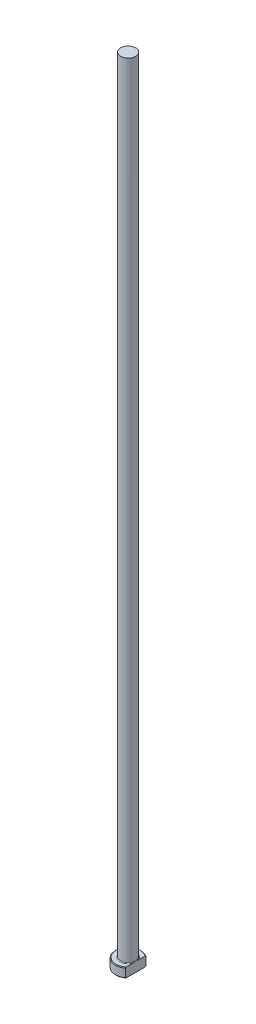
from build123d import *
from build123d.topology import SkipClean

# Parameters (mm, degrees)
CHAMFER1_SIZE = 0.2
FILLET1_R     = 0.2
KEY_DEPTH     = 251.06399181


with BuildPart() as part:
    # Sketch1 → Revolve1 (revolve)
    with BuildSketch(Plane.XY, mode=Mode.PRIVATE) as revolve1_sk:
        Polygon((0, 0), (-4, 0), (-4, 3), (-2.35, 3), (-2.35, 250), (0, 250), align=None)
    revolve(revolve1_sk.sketch.rotate(Axis((0, 259.958771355, 0), (0, -1, 0)), 270), axis=Axis((0, 259.958771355, 0), (0, -1, 0)))

    # Chamfer1
    chamfer1_edges = [part.edges().sort_by_distance(p)[0] for p in [
        (0, 3, -4),
        (0, 0, -4),
    ]]
    chamfer(chamfer1_edges, length=CHAMFER1_SIZE)

    # Fillet1
    fillet1_edges = [part.edges().sort_by_distance(p)[0] for p in [
        (0, 3, -2.35),
    ]]
    fillet(fillet1_edges, radius=FILLET1_R)

    # Sketch2 → KEY (cut, through all)
    with SkipClean():  # the faces are left unmerged after this step: merging them gives an invalid solid
        with BuildSketch(Plane(origin=(0, 0, 0), x_dir=(1, 0, 0), z_dir=(0, 1, 0))):
            with BuildLine():
                Line((2.35, 3.236896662), (2.35, -3.236896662))
                ThreePointArc((2.35, -3.236896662), (4, 0), (2.35, 3.236896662))
            make_face()
        extrude(amount=KEY_DEPTH, mode=Mode.SUBTRACT)


solid = part.part
